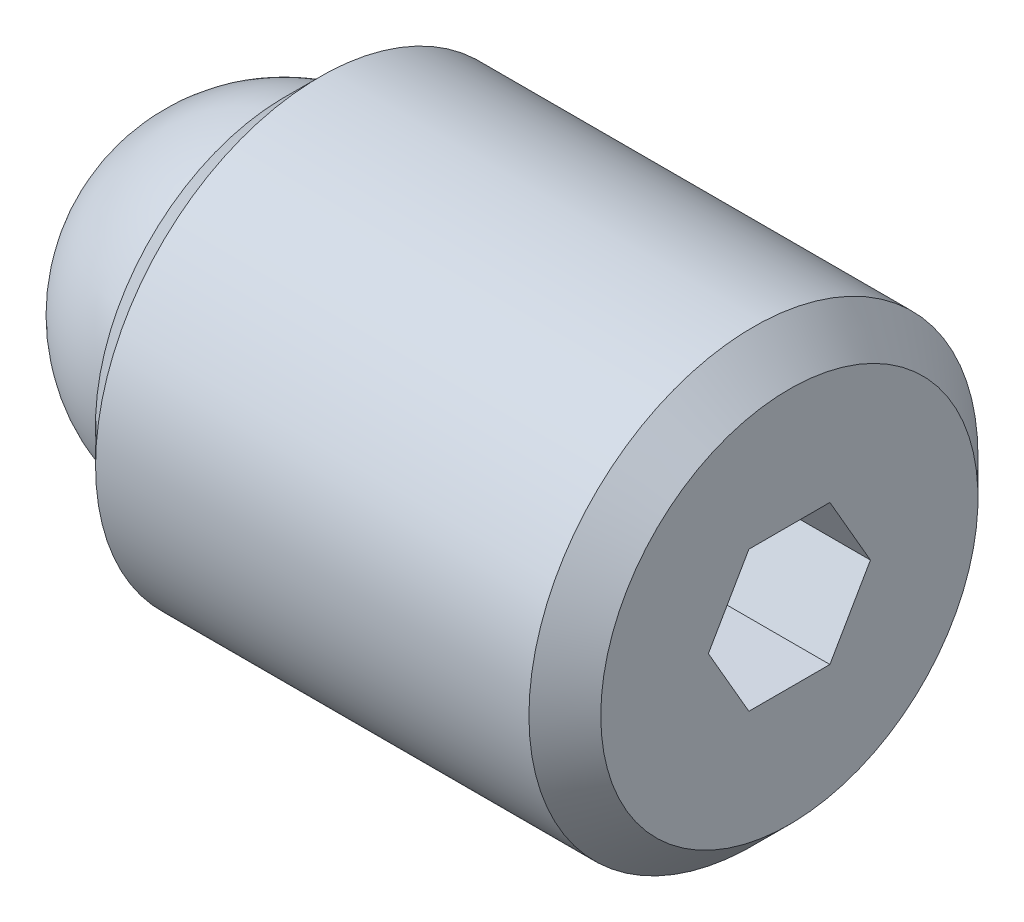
from build123d import *

# Parameters (mm, degrees)
SKETCH2_R           = 3.175
BOSS_EXTRUDE1_DEPTH = 7.14375
CHAMFER1_SIZE       = 0.508
CHAMFER2_SIZE       = 0.508
CUT_EXTRUDE2_DEPTH  = 2.286
SKETCH3_R           = 2.38125
CUT_EXTRUDE3_DEPTH  = 2.38125
CUT_EXTRUDE4_DEPTH  = 2.38125


with BuildPart() as part:
    # Sketch2 → Boss-Extrude1 (new body)
    with BuildSketch(Plane(origin=(0, 0, 0), x_dir=(0, 0, -1), z_dir=(1, 0, 0))):
        Circle(SKETCH2_R)
    extrude(amount=BOSS_EXTRUDE1_DEPTH)

    # Chamfer1
    chamfer1_edges = [part.edges().sort_by_distance(p)[0] for p in [
        (0, 0, 3.175),
    ]]
    chamfer(chamfer1_edges, length=CHAMFER1_SIZE)

    # Chamfer2
    chamfer2_edges = [part.edges().sort_by_distance(p)[0] for p in [
        (7.14375, 0, 3.175),
    ]]
    chamfer(chamfer2_edges, length=CHAMFER2_SIZE)

    # Sketch4 → Cut-Extrude2 (cut)
    with BuildSketch(Plane(origin=(7.14375, 0, 0), x_dir=(0, 0, -1), z_dir=(1, 0, 0))):
        Polygon((1.14567944, 0), (0.57283972, 0.9921875), (-0.57283972, 0.9921875), (-1.14567944, 0), (-0.57283972, -0.9921875), (0.57283972, -0.9921875), align=None)
    extrude(amount=-CUT_EXTRUDE2_DEPTH, mode=Mode.SUBTRACT)

    # Sketch3 → Cut-Extrude3 (cut)
    with BuildSketch(Plane.ZY):
        Circle(SKETCH3_R)
    extrude(amount=-CUT_EXTRUDE3_DEPTH, mode=Mode.SUBTRACT)

    # Sketch7 → Cut-Extrude4 (cut)
    with BuildSketch(Plane.ZY):
        with BuildLine():
            ThreePointArc((0.063494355, 2.380403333), (0, 2.38125), (-0.063494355, 2.380403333))
            ThreePointArc((-0.063494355, 2.380403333), (0, 2.44475), (0.063494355, 2.380403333))
        make_face()
    extrude(amount=-CUT_EXTRUDE4_DEPTH, mode=Mode.SUBTRACT)


with BuildPart() as body_2:
    # Sketch5 → Revolve1 (revolve)
    with BuildSketch(Plane.ZY):
        with BuildLine():
            Line((0, 0), (0, -2.38125))
            ThreePointArc((0, -2.38125), (-2.38125, 0), (0, 2.38125))
            Line((0, 2.38125), (0, 0))
        make_face()
    revolve(axis=Axis((0, 0, 0), (0, 1, 0)))


solid = Compound([part.part, body_2.part])
